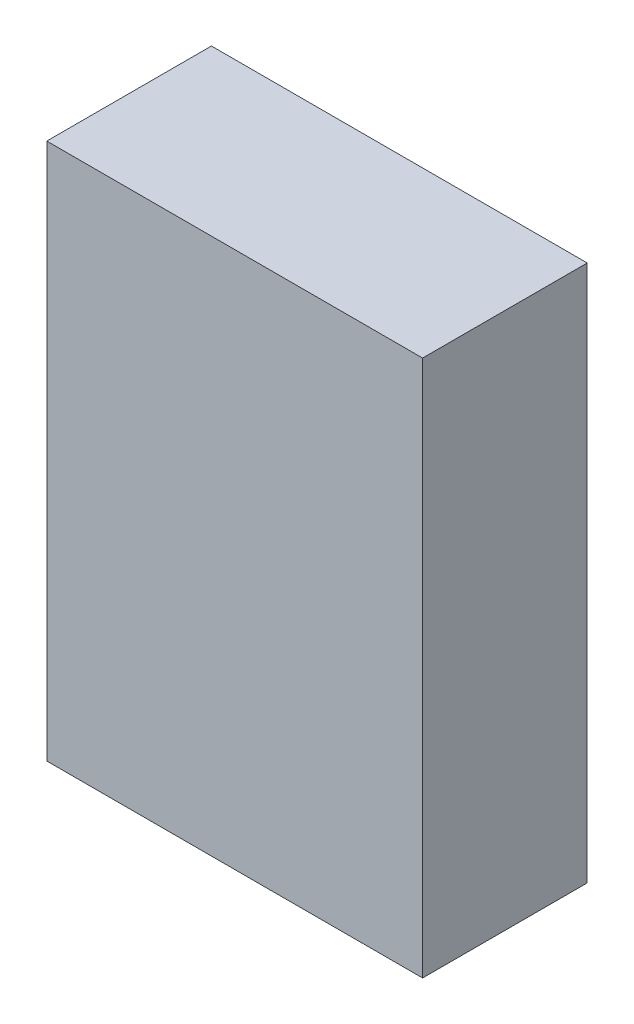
ISO-10303-21;
HEADER;
FILE_DESCRIPTION(('STEP AP214'),'2;1');
FILE_NAME('part.step','',(''),(''),'','','');
FILE_SCHEMA(('AUTOMOTIVE_DESIGN { 1 0 10303 214 1 1 1 1 }'));
ENDSEC;
DATA;
#1=APPLICATION_CONTEXT('core data for automotive mechanical design processes');
#2=APPLICATION_PROTOCOL_DEFINITION('international standard','automotive_design',2000,#1);
#3=PRODUCT_CONTEXT('',#1,'mechanical');
#4=PRODUCT('Part','Part','',(#3));
#5=PRODUCT_RELATED_PRODUCT_CATEGORY('part','',(#4));
#6=PRODUCT_DEFINITION_FORMATION('','',#4);
#7=PRODUCT_DEFINITION_CONTEXT('part definition',#1,'design');
#8=PRODUCT_DEFINITION('design','',#6,#7);
#9=PRODUCT_DEFINITION_SHAPE('','',#8);
#10=(LENGTH_UNIT() NAMED_UNIT(*) SI_UNIT(.MILLI.,.METRE.));
#11=(NAMED_UNIT(*) PLANE_ANGLE_UNIT() SI_UNIT($,.RADIAN.));
#12=(NAMED_UNIT(*) SI_UNIT($,.STERADIAN.) SOLID_ANGLE_UNIT());
#13=UNCERTAINTY_MEASURE_WITH_UNIT(LENGTH_MEASURE(1.E-05),#10,'distance_accuracy_value','');
#14=(GEOMETRIC_REPRESENTATION_CONTEXT(3) GLOBAL_UNCERTAINTY_ASSIGNED_CONTEXT((#13)) GLOBAL_UNIT_ASSIGNED_CONTEXT((#10,
#11,#12)) REPRESENTATION_CONTEXT('',''));
#15=CARTESIAN_POINT('',(0.,0.,0.));
#16=DIRECTION('',(0.,0.,1.));
#17=DIRECTION('',(1.,0.,0.));
#18=AXIS2_PLACEMENT_3D('',#15,#16,#17);
#19=CARTESIAN_POINT('',(0.533386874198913,0.750092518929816,4.58969577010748E-08));
#20=DIRECTION('',(4.37113882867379E-08,0.,-0.999999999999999));
#21=DIRECTION('',(0.999999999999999,1.1924880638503E-08,4.37113882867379E-08));
#22=AXIS2_PLACEMENT_3D('',#19,#20,#21);
#23=PLANE('',#22);
#24=DIRECTION('',(1.19248806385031E-08,-1.,0.));
#25=VECTOR('',#24,1.);
#26=CARTESIAN_POINT('',(0.483386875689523,0.625092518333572,4.37113882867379E-08));
#27=LINE('',#26,#25);
#28=CARTESIAN_POINT('',(0.483386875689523,0.625092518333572,4.37113882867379E-08));
#29=VERTEX_POINT('',#28);
#30=CARTESIAN_POINT('',(0.483386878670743,0.375092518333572,4.37113882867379E-08));
#31=VERTEX_POINT('',#30);
#32=EDGE_CURVE('E11',#29,#31,#27,.T.);
#33=ORIENTED_EDGE('',*,*,#32,.F.);
#34=DIRECTION('',(0.999999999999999,1.1924880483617E-08,4.37113882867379E-08));
#35=VECTOR('',#34,1.);
#36=CARTESIAN_POINT('',(0.133386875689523,0.625092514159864,2.84124023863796E-08));
#37=LINE('',#36,#35);
#38=CARTESIAN_POINT('',(0.133386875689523,0.625092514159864,2.84124023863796E-08));
#39=VERTEX_POINT('',#38);
#40=EDGE_CURVE('E24',#39,#29,#37,.T.);
#41=ORIENTED_EDGE('',*,*,#40,.F.);
#42=DIRECTION('',(-1.19248810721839E-08,1.,0.));
#43=VECTOR('',#42,1.);
#44=CARTESIAN_POINT('',(0.133386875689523,0.625092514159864,2.84124023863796E-08));
#45=LINE('',#44,#43);
#46=CARTESIAN_POINT('',(0.133386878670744,0.375092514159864,2.84124023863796E-08));
#47=VERTEX_POINT('',#46);
#48=EDGE_CURVE('E441',#47,#39,#45,.T.);
#49=ORIENTED_EDGE('',*,*,#48,.F.);
#50=DIRECTION('',(-0.999999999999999,-1.1924880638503E-08,-4.37113882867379E-08));
#51=VECTOR('',#50,1.);
#52=CARTESIAN_POINT('',(0.133386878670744,0.375092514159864,2.84124023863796E-08));
#53=LINE('',#52,#51);
#54=EDGE_CURVE('E438',#31,#47,#53,.T.);
#55=ORIENTED_EDGE('',*,*,#54,.F.);
#56=EDGE_LOOP('',(#33,#41,#49,#55));
#57=FACE_BOUND('',#56,.T.);
#58=DIRECTION('',(1.19248806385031E-08,-1.,0.));
#59=VECTOR('',#58,1.);
#60=CARTESIAN_POINT('',(0.483386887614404,-0.374907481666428,4.37113882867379E-08));
#61=LINE('',#60,#59);
#62=CARTESIAN_POINT('',(0.483386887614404,-0.374907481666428,4.37113882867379E-08));
#63=VERTEX_POINT('',#62);
#64=CARTESIAN_POINT('',(0.483386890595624,-0.624907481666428,4.37113882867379E-08));
#65=VERTEX_POINT('',#64);
#66=EDGE_CURVE('E436',#63,#65,#61,.T.);
#67=ORIENTED_EDGE('',*,*,#66,.F.);
#68=DIRECTION('',(0.999999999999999,1.1924880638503E-08,4.37113882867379E-08));
#69=VECTOR('',#68,1.);
#70=CARTESIAN_POINT('',(0.133386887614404,-0.374907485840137,2.84124023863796E-08));
#71=LINE('',#70,#69);
#72=CARTESIAN_POINT('',(0.133386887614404,-0.374907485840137,2.84124023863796E-08));
#73=VERTEX_POINT('',#72);
#74=EDGE_CURVE('E433',#73,#63,#71,.T.);
#75=ORIENTED_EDGE('',*,*,#74,.F.);
#76=DIRECTION('',(-1.19248810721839E-08,1.,0.));
#77=VECTOR('',#76,1.);
#78=CARTESIAN_POINT('',(0.133386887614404,-0.374907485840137,2.84124023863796E-08));
#79=LINE('',#78,#77);
#80=CARTESIAN_POINT('',(0.133386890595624,-0.624907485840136,2.84124023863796E-08));
#81=VERTEX_POINT('',#80);
#82=EDGE_CURVE('E430',#81,#73,#79,.T.);
#83=ORIENTED_EDGE('',*,*,#82,.F.);
#84=DIRECTION('',(-0.999999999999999,-1.1924880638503E-08,-4.37113882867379E-08));
#85=VECTOR('',#84,1.);
#86=CARTESIAN_POINT('',(0.133386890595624,-0.624907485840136,2.84124023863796E-08));
#87=LINE('',#86,#85);
#88=EDGE_CURVE('E427',#65,#81,#87,.T.);
#89=ORIENTED_EDGE('',*,*,#88,.F.);
#90=EDGE_LOOP('',(#67,#75,#83,#89));
#91=FACE_BOUND('',#90,.T.);
#92=DIRECTION('',(1.19248808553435E-08,-1.,0.));
#93=VECTOR('',#92,1.);
#94=CARTESIAN_POINT('',(-0.116613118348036,0.125092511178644,1.74845553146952E-08));
#95=LINE('',#94,#93);
#96=CARTESIAN_POINT('',(-0.116613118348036,0.125092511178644,1.74845553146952E-08));
#97=VERTEX_POINT('',#96);
#98=CARTESIAN_POINT('',(-0.116613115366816,-0.124907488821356,1.74845553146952E-08));
#99=VERTEX_POINT('',#98);
#100=EDGE_CURVE('E425',#97,#99,#95,.T.);
#101=ORIENTED_EDGE('',*,*,#100,.F.);
#102=DIRECTION('',(0.999999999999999,1.1924880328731E-08,4.37113882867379E-08));
#103=VECTOR('',#102,1.);
#104=CARTESIAN_POINT('',(-0.466613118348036,0.125092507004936,2.18556941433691E-09));
#105=LINE('',#104,#103);
#106=CARTESIAN_POINT('',(-0.466613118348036,0.125092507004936,2.18556941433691E-09));
#107=VERTEX_POINT('',#106);
#108=EDGE_CURVE('E422',#107,#97,#105,.T.);
#109=ORIENTED_EDGE('',*,*,#108,.F.);
#110=DIRECTION('',(-1.19248806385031E-08,1.,0.));
#111=VECTOR('',#110,1.);
#112=CARTESIAN_POINT('',(-0.466613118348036,0.125092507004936,2.18556941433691E-09));
#113=LINE('',#112,#111);
#114=CARTESIAN_POINT('',(-0.466613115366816,-0.124907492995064,2.18556941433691E-09));
#115=VERTEX_POINT('',#114);
#116=EDGE_CURVE('E419',#115,#107,#113,.T.);
#117=ORIENTED_EDGE('',*,*,#116,.F.);
#118=DIRECTION('',(-0.999999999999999,-1.1924880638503E-08,-4.37113882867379E-08));
#119=VECTOR('',#118,1.);
#120=CARTESIAN_POINT('',(-0.466613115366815,-0.124907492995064,2.18556941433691E-09));
#121=LINE('',#120,#119);
#122=EDGE_CURVE('E416',#99,#115,#121,.T.);
#123=ORIENTED_EDGE('',*,*,#122,.F.);
#124=EDGE_LOOP('',(#101,#109,#117,#123));
#125=FACE_BOUND('',#124,.T.);
#126=DIRECTION('',(-0.999999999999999,-1.1924880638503E-08,-4.37113882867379E-08));
#127=VECTOR('',#126,1.);
#128=CARTESIAN_POINT('',(-0.516613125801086,0.750092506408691,0.));
#129=LINE('',#128,#127);
#130=CARTESIAN_POINT('',(0.533386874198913,0.750092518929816,4.58969577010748E-08));
#131=VERTEX_POINT('',#130);
#132=CARTESIAN_POINT('',(-0.516613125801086,0.750092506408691,0.));
#133=VERTEX_POINT('',#132);
#134=EDGE_CURVE('E413',#131,#133,#129,.T.);
#135=ORIENTED_EDGE('',*,*,#134,.F.);
#136=DIRECTION('',(-1.19248806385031E-08,1.,0.));
#137=VECTOR('',#136,1.);
#138=CARTESIAN_POINT('',(0.533386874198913,0.750092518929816,4.58969577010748E-08));
#139=LINE('',#138,#137);
#140=CARTESIAN_POINT('',(0.533386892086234,-0.749907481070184,4.58969577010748E-08));
#141=VERTEX_POINT('',#140);
#142=EDGE_CURVE('E410',#141,#131,#139,.T.);
#143=ORIENTED_EDGE('',*,*,#142,.F.);
#144=DIRECTION('',(0.999999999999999,1.19248818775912E-08,4.37113882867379E-08));
#145=VECTOR('',#144,1.);
#146=CARTESIAN_POINT('',(-0.516613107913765,-0.74990749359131,0.));
#147=LINE('',#146,#145);
#148=CARTESIAN_POINT('',(-0.516613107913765,-0.74990749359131,0.));
#149=VERTEX_POINT('',#148);
#150=EDGE_CURVE('E407',#149,#141,#147,.T.);
#151=ORIENTED_EDGE('',*,*,#150,.F.);
#152=DIRECTION('',(1.19248806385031E-08,-1.,0.));
#153=VECTOR('',#152,1.);
#154=CARTESIAN_POINT('',(-0.516613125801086,0.750092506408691,0.));
#155=LINE('',#154,#153);
#156=EDGE_CURVE('E404',#133,#149,#155,.T.);
#157=ORIENTED_EDGE('',*,*,#156,.F.);
#158=EDGE_LOOP('',(#135,#143,#151,#157));
#159=FACE_BOUND('',#158,.T.);
#160=DIRECTION('',(1.19248806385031E-08,-1.,0.));
#161=VECTOR('',#160,1.);
#162=CARTESIAN_POINT('',(-0.116613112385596,-0.374907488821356,1.74845553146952E-08));
#163=LINE('',#162,#161);
#164=CARTESIAN_POINT('',(-0.116613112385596,-0.374907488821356,1.74845553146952E-08));
#165=VERTEX_POINT('',#164);
#166=CARTESIAN_POINT('',(-0.116613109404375,-0.624907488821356,1.74845553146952E-08));
#167=VERTEX_POINT('',#166);
#168=EDGE_CURVE('E401',#165,#167,#163,.T.);
#169=ORIENTED_EDGE('',*,*,#168,.F.);
#170=DIRECTION('',(0.999999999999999,1.1924880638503E-08,4.37113882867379E-08));
#171=VECTOR('',#170,1.);
#172=CARTESIAN_POINT('',(-0.466613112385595,-0.374907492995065,2.18556941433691E-09));
#173=LINE('',#172,#171);
#174=CARTESIAN_POINT('',(-0.466613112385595,-0.374907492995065,2.18556941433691E-09));
#175=VERTEX_POINT('',#174);
#176=EDGE_CURVE('E398',#175,#165,#173,.T.);
#177=ORIENTED_EDGE('',*,*,#176,.F.);
#178=DIRECTION('',(-1.19248806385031E-08,1.,0.));
#179=VECTOR('',#178,1.);
#180=CARTESIAN_POINT('',(-0.466613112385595,-0.374907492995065,2.18556941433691E-09));
#181=LINE('',#180,#179);
#182=CARTESIAN_POINT('',(-0.466613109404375,-0.624907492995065,2.18556941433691E-09));
#183=VERTEX_POINT('',#182);
#184=EDGE_CURVE('E395',#183,#175,#181,.T.);
#185=ORIENTED_EDGE('',*,*,#184,.F.);
#186=DIRECTION('',(-0.999999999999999,-1.1924880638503E-08,-4.37113882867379E-08));
#187=VECTOR('',#186,1.);
#188=CARTESIAN_POINT('',(-0.466613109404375,-0.624907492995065,2.18556941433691E-09));
#189=LINE('',#188,#187);
#190=EDGE_CURVE('E392',#167,#183,#189,.T.);
#191=ORIENTED_EDGE('',*,*,#190,.F.);
#192=EDGE_LOOP('',(#169,#177,#185,#191));
#193=FACE_BOUND('',#192,.T.);
#194=DIRECTION('',(1.19248806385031E-08,-1.,0.));
#195=VECTOR('',#194,1.);
#196=CARTESIAN_POINT('',(0.483386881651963,0.125092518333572,4.37113882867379E-08));
#197=LINE('',#196,#195);
#198=CARTESIAN_POINT('',(0.483386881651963,0.125092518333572,4.37113882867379E-08));
#199=VERTEX_POINT('',#198);
#200=CARTESIAN_POINT('',(0.483386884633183,-0.124907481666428,4.37113882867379E-08));
#201=VERTEX_POINT('',#200);
#202=EDGE_CURVE('E389',#199,#201,#197,.T.);
#203=ORIENTED_EDGE('',*,*,#202,.F.);
#204=DIRECTION('',(0.999999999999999,1.1924880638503E-08,4.37113882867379E-08));
#205=VECTOR('',#204,1.);
#206=CARTESIAN_POINT('',(0.133386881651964,0.125092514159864,2.84124023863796E-08));
#207=LINE('',#206,#205);
#208=CARTESIAN_POINT('',(0.133386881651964,0.125092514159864,2.84124023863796E-08));
#209=VERTEX_POINT('',#208);
#210=EDGE_CURVE('E387',#209,#199,#207,.T.);
#211=ORIENTED_EDGE('',*,*,#210,.F.);
#212=DIRECTION('',(-1.19248806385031E-08,1.,0.));
#213=VECTOR('',#212,1.);
#214=CARTESIAN_POINT('',(0.133386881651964,0.125092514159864,2.84124023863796E-08));
#215=LINE('',#214,#213);
#216=CARTESIAN_POINT('',(0.133386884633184,-0.124907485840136,2.84124023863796E-08));
#217=VERTEX_POINT('',#216);
#218=EDGE_CURVE('E384',#217,#209,#215,.T.);
#219=ORIENTED_EDGE('',*,*,#218,.F.);
#220=DIRECTION('',(-0.999999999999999,-1.1924880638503E-08,-4.37113882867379E-08));
#221=VECTOR('',#220,1.);
#222=CARTESIAN_POINT('',(0.133386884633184,-0.124907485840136,2.84124023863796E-08));
#223=LINE('',#222,#221);
#224=EDGE_CURVE('E381',#201,#217,#223,.T.);
#225=ORIENTED_EDGE('',*,*,#224,.F.);
#226=EDGE_LOOP('',(#203,#211,#219,#225));
#227=FACE_BOUND('',#226,.T.);
#228=DIRECTION('',(-1.19248806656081E-08,1.,0.));
#229=VECTOR('',#228,1.);
#230=CARTESIAN_POINT('',(-0.466613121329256,0.375092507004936,2.18556941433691E-09));
#231=LINE('',#230,#229);
#232=CARTESIAN_POINT('',(-0.466613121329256,0.375092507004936,2.18556941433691E-09));
#233=VERTEX_POINT('',#232);
#234=CARTESIAN_POINT('',(-0.466613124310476,0.625092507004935,2.18556941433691E-09));
#235=VERTEX_POINT('',#234);
#236=EDGE_CURVE('E379',#233,#235,#231,.T.);
#237=ORIENTED_EDGE('',*,*,#236,.F.);
#238=DIRECTION('',(-0.999999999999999,-1.1924880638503E-08,-4.37113882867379E-08));
#239=VECTOR('',#238,1.);
#240=CARTESIAN_POINT('',(-0.0666131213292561,0.375092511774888,1.96701247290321E-08));
#241=LINE('',#240,#239);
#242=CARTESIAN_POINT('',(-0.0666131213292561,0.375092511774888,1.96701247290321E-08));
#243=VERTEX_POINT('',#242);
#244=EDGE_CURVE('E376',#243,#233,#241,.T.);
#245=ORIENTED_EDGE('',*,*,#244,.F.);
#246=DIRECTION('',(1.19248806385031E-08,-1.,0.));
#247=VECTOR('',#246,1.);
#248=CARTESIAN_POINT('',(-0.0666131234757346,0.555092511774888,1.96701247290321E-08));
#249=LINE('',#248,#247);
#250=CARTESIAN_POINT('',(-0.0666131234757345,0.555092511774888,1.96701247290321E-08));
#251=VERTEX_POINT('',#250);
#252=EDGE_CURVE('E374',#251,#243,#249,.T.);
#253=ORIENTED_EDGE('',*,*,#252,.F.);
#254=DIRECTION('',(0.731055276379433,-0.682318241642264,3.19554406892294E-08));
#255=VECTOR('',#254,1.);
#256=CARTESIAN_POINT('',(-0.141613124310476,0.625092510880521,1.63917706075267E-08));
#257=LINE('',#256,#255);
#258=CARTESIAN_POINT('',(-0.141613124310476,0.625092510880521,1.63917706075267E-08));
#259=VERTEX_POINT('',#258);
#260=EDGE_CURVE('E210',#259,#251,#257,.T.);
#261=ORIENTED_EDGE('',*,*,#260,.F.);
#262=DIRECTION('',(0.999999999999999,1.1924880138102E-08,4.37113882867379E-08));
#263=VECTOR('',#262,1.);
#264=CARTESIAN_POINT('',(-0.466613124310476,0.625092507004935,2.18556941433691E-09));
#265=LINE('',#264,#263);
#266=EDGE_CURVE('E370',#235,#259,#265,.T.);
#267=ORIENTED_EDGE('',*,*,#266,.F.);
#268=EDGE_LOOP('',(#237,#245,#253,#261,#267));
#269=FACE_BOUND('',#268,.T.);
#270=ADVANCED_FACE('F17',(#57,#91,#125,#159,#193,#227,#269),#23,.T.);
#271=CARTESIAN_POINT('',(-0.516613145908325,0.750092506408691,0.46));
#272=DIRECTION('',(1.19248806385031E-08,-1.,0.));
#273=DIRECTION('',(0.999999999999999,1.1924880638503E-08,4.37113882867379E-08));
#274=AXIS2_PLACEMENT_3D('',#271,#272,#273);
#275=PLANE('',#274);
#276=ORIENTED_EDGE('',*,*,#134,.T.);
#277=DIRECTION('',(4.37113882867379E-08,0.,-0.999999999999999));
#278=VECTOR('',#277,1.);
#279=CARTESIAN_POINT('',(-0.516613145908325,0.750092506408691,0.46));
#280=LINE('',#279,#278);
#281=CARTESIAN_POINT('',(-0.516613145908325,0.750092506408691,0.46));
#282=VERTEX_POINT('',#281);
#283=EDGE_CURVE('E368',#282,#133,#280,.T.);
#284=ORIENTED_EDGE('',*,*,#283,.F.);
#285=DIRECTION('',(-0.999999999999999,-1.1924880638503E-08,-4.37113882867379E-08));
#286=VECTOR('',#285,1.);
#287=CARTESIAN_POINT('',(-0.516613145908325,0.750092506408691,0.46));
#288=LINE('',#287,#286);
#289=CARTESIAN_POINT('',(0.533386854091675,0.750092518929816,0.460000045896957));
#290=VERTEX_POINT('',#289);
#291=EDGE_CURVE('E365',#290,#282,#288,.T.);
#292=ORIENTED_EDGE('',*,*,#291,.F.);
#293=DIRECTION('',(4.37113882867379E-08,0.,-0.999999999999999));
#294=VECTOR('',#293,1.);
#295=CARTESIAN_POINT('',(0.533386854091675,0.750092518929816,0.460000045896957));
#296=LINE('',#295,#294);
#297=EDGE_CURVE('E362',#290,#131,#296,.T.);
#298=ORIENTED_EDGE('',*,*,#297,.T.);
#299=EDGE_LOOP('',(#276,#284,#292,#298));
#300=FACE_BOUND('',#299,.T.);
#301=ADVANCED_FACE('F460',(#300),#275,.F.);
#302=CARTESIAN_POINT('',(-0.516613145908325,0.750092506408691,0.46));
#303=DIRECTION('',(0.999999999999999,1.1924880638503E-08,4.37113882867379E-08));
#304=DIRECTION('',(-1.19248806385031E-08,1.,0.));
#305=AXIS2_PLACEMENT_3D('',#302,#303,#304);
#306=PLANE('',#305);
#307=ORIENTED_EDGE('',*,*,#156,.T.);
#308=DIRECTION('',(4.37113882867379E-08,0.,-0.999999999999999));
#309=VECTOR('',#308,1.);
#310=CARTESIAN_POINT('',(-0.516613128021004,-0.74990749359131,0.46));
#311=LINE('',#310,#309);
#312=CARTESIAN_POINT('',(-0.516613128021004,-0.74990749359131,0.46));
#313=VERTEX_POINT('',#312);
#314=EDGE_CURVE('E360',#313,#149,#311,.T.);
#315=ORIENTED_EDGE('',*,*,#314,.F.);
#316=DIRECTION('',(1.19248806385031E-08,-1.,0.));
#317=VECTOR('',#316,1.);
#318=CARTESIAN_POINT('',(-0.516613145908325,0.750092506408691,0.46));
#319=LINE('',#318,#317);
#320=EDGE_CURVE('E357',#282,#313,#319,.T.);
#321=ORIENTED_EDGE('',*,*,#320,.F.);
#322=ORIENTED_EDGE('',*,*,#283,.T.);
#323=EDGE_LOOP('',(#307,#315,#321,#322));
#324=FACE_BOUND('',#323,.T.);
#325=ADVANCED_FACE('F598',(#324),#306,.F.);
#326=CARTESIAN_POINT('',(-0.516613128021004,-0.74990749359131,0.46));
#327=DIRECTION('',(-1.19248818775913E-08,1.,0.));
#328=DIRECTION('',(-0.999999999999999,-1.19248818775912E-08,-4.37113882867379E-08));
#329=AXIS2_PLACEMENT_3D('',#326,#327,#328);
#330=PLANE('',#329);
#331=ORIENTED_EDGE('',*,*,#150,.T.);
#332=DIRECTION('',(4.37113882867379E-08,0.,-0.999999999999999));
#333=VECTOR('',#332,1.);
#334=CARTESIAN_POINT('',(0.533386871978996,-0.749907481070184,0.460000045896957));
#335=LINE('',#334,#333);
#336=CARTESIAN_POINT('',(0.533386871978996,-0.749907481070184,0.460000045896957));
#337=VERTEX_POINT('',#336);
#338=EDGE_CURVE('E355',#337,#141,#335,.T.);
#339=ORIENTED_EDGE('',*,*,#338,.F.);
#340=DIRECTION('',(0.999999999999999,1.19248818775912E-08,4.37113882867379E-08));
#341=VECTOR('',#340,1.);
#342=CARTESIAN_POINT('',(-0.516613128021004,-0.74990749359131,0.46));
#343=LINE('',#342,#341);
#344=EDGE_CURVE('E352',#313,#337,#343,.T.);
#345=ORIENTED_EDGE('',*,*,#344,.F.);
#346=ORIENTED_EDGE('',*,*,#314,.T.);
#347=EDGE_LOOP('',(#331,#339,#345,#346));
#348=FACE_BOUND('',#347,.T.);
#349=ADVANCED_FACE('F594',(#348),#330,.F.);
#350=CARTESIAN_POINT('',(0.533386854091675,0.750092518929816,0.460000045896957));
#351=DIRECTION('',(-0.999999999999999,-1.1924880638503E-08,-4.37113882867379E-08));
#352=DIRECTION('',(1.19248806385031E-08,-1.,0.));
#353=AXIS2_PLACEMENT_3D('',#350,#351,#352);
#354=PLANE('',#353);
#355=ORIENTED_EDGE('',*,*,#142,.T.);
#356=ORIENTED_EDGE('',*,*,#297,.F.);
#357=DIRECTION('',(-1.19248806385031E-08,1.,0.));
#358=VECTOR('',#357,1.);
#359=CARTESIAN_POINT('',(0.533386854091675,0.750092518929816,0.460000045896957));
#360=LINE('',#359,#358);
#361=EDGE_CURVE('E349',#337,#290,#360,.T.);
#362=ORIENTED_EDGE('',*,*,#361,.F.);
#363=ORIENTED_EDGE('',*,*,#338,.T.);
#364=EDGE_LOOP('',(#355,#356,#362,#363));
#365=FACE_BOUND('',#364,.T.);
#366=ADVANCED_FACE('F590',(#365),#354,.F.);
#367=CARTESIAN_POINT('',(0.533386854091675,0.750092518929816,0.460000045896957));
#368=DIRECTION('',(4.37113882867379E-08,0.,-0.999999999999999));
#369=DIRECTION('',(0.999999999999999,1.1924880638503E-08,4.37113882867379E-08));
#370=AXIS2_PLACEMENT_3D('',#367,#368,#369);
#371=PLANE('',#370);
#372=ORIENTED_EDGE('',*,*,#291,.T.);
#373=ORIENTED_EDGE('',*,*,#320,.T.);
#374=ORIENTED_EDGE('',*,*,#344,.T.);
#375=ORIENTED_EDGE('',*,*,#361,.T.);
#376=EDGE_LOOP('',(#372,#373,#374,#375));
#377=FACE_BOUND('',#376,.T.);
#378=ADVANCED_FACE('F586',(#377),#371,.F.);
#379=CARTESIAN_POINT('',(-0.46661311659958,0.125092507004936,-0.0399999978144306));
#380=DIRECTION('',(1.1924880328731E-08,-1.,0.));
#381=DIRECTION('',(0.999999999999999,1.1924880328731E-08,4.37113882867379E-08));
#382=AXIS2_PLACEMENT_3D('',#379,#380,#381);
#383=PLANE('',#382);
#384=ORIENTED_EDGE('',*,*,#108,.T.);
#385=DIRECTION('',(-4.37113882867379E-08,0.,0.999999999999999));
#386=VECTOR('',#385,1.);
#387=CARTESIAN_POINT('',(-0.11661311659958,0.125092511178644,-0.0399999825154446));
#388=LINE('',#387,#386);
#389=CARTESIAN_POINT('',(-0.11661311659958,0.125092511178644,-0.0399999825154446));
#390=VERTEX_POINT('',#389);
#391=EDGE_CURVE('E346',#390,#97,#388,.T.);
#392=ORIENTED_EDGE('',*,*,#391,.F.);
#393=DIRECTION('',(0.999999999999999,1.1924880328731E-08,4.37113882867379E-08));
#394=VECTOR('',#393,1.);
#395=CARTESIAN_POINT('',(-0.46661311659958,0.125092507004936,-0.0399999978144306));
#396=LINE('',#395,#394);
#397=CARTESIAN_POINT('',(-0.46661311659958,0.125092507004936,-0.0399999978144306));
#398=VERTEX_POINT('',#397);
#399=EDGE_CURVE('E343',#398,#390,#396,.T.);
#400=ORIENTED_EDGE('',*,*,#399,.F.);
#401=DIRECTION('',(-4.37113882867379E-08,0.,0.999999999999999));
#402=VECTOR('',#401,1.);
#403=CARTESIAN_POINT('',(-0.46661311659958,0.125092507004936,-0.0399999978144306));
#404=LINE('',#403,#402);
#405=EDGE_CURVE('E340',#398,#107,#404,.T.);
#406=ORIENTED_EDGE('',*,*,#405,.T.);
#407=EDGE_LOOP('',(#384,#392,#400,#406));
#408=FACE_BOUND('',#407,.T.);
#409=ADVANCED_FACE('F582',(#408),#383,.F.);
#410=CARTESIAN_POINT('',(-0.11661311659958,0.125092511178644,-0.0399999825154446));
#411=DIRECTION('',(-0.999999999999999,-1.19248808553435E-08,-4.37113882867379E-08));
#412=DIRECTION('',(1.19248808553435E-08,-1.,0.));
#413=AXIS2_PLACEMENT_3D('',#410,#411,#412);
#414=PLANE('',#413);
#415=ORIENTED_EDGE('',*,*,#100,.T.);
#416=DIRECTION('',(-4.37113882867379E-08,0.,0.999999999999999));
#417=VECTOR('',#416,1.);
#418=CARTESIAN_POINT('',(-0.11661311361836,-0.124907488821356,-0.0399999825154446));
#419=LINE('',#418,#417);
#420=CARTESIAN_POINT('',(-0.11661311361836,-0.124907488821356,-0.0399999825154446));
#421=VERTEX_POINT('',#420);
#422=EDGE_CURVE('E337',#421,#99,#419,.T.);
#423=ORIENTED_EDGE('',*,*,#422,.F.);
#424=DIRECTION('',(1.19248808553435E-08,-1.,0.));
#425=VECTOR('',#424,1.);
#426=CARTESIAN_POINT('',(-0.11661311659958,0.125092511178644,-0.0399999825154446));
#427=LINE('',#426,#425);
#428=EDGE_CURVE('E334',#390,#421,#427,.T.);
#429=ORIENTED_EDGE('',*,*,#428,.F.);
#430=ORIENTED_EDGE('',*,*,#391,.T.);
#431=EDGE_LOOP('',(#415,#423,#429,#430));
#432=FACE_BOUND('',#431,.T.);
#433=ADVANCED_FACE('F578',(#432),#414,.F.);
#434=CARTESIAN_POINT('',(-0.46661311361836,-0.124907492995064,-0.0399999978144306));
#435=DIRECTION('',(-1.19248806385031E-08,1.,0.));
#436=DIRECTION('',(-0.999999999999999,-1.1924880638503E-08,-4.37113882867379E-08));
#437=AXIS2_PLACEMENT_3D('',#434,#435,#436);
#438=PLANE('',#437);
#439=ORIENTED_EDGE('',*,*,#122,.T.);
#440=DIRECTION('',(-4.37113882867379E-08,0.,0.999999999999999));
#441=VECTOR('',#440,1.);
#442=CARTESIAN_POINT('',(-0.46661311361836,-0.124907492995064,-0.0399999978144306));
#443=LINE('',#442,#441);
#444=CARTESIAN_POINT('',(-0.46661311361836,-0.124907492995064,-0.0399999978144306));
#445=VERTEX_POINT('',#444);
#446=EDGE_CURVE('E331',#445,#115,#443,.T.);
#447=ORIENTED_EDGE('',*,*,#446,.F.);
#448=DIRECTION('',(-0.999999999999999,-1.1924880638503E-08,-4.37113882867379E-08));
#449=VECTOR('',#448,1.);
#450=CARTESIAN_POINT('',(-0.46661311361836,-0.124907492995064,-0.0399999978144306));
#451=LINE('',#450,#449);
#452=EDGE_CURVE('E329',#421,#445,#451,.T.);
#453=ORIENTED_EDGE('',*,*,#452,.F.);
#454=ORIENTED_EDGE('',*,*,#422,.T.);
#455=EDGE_LOOP('',(#439,#447,#453,#454));
#456=FACE_BOUND('',#455,.T.);
#457=ADVANCED_FACE('F574',(#456),#438,.F.);
#458=CARTESIAN_POINT('',(-0.46661311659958,0.125092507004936,-0.0399999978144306));
#459=DIRECTION('',(0.999999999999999,1.1924880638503E-08,4.37113882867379E-08));
#460=DIRECTION('',(-1.19248806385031E-08,1.,0.));
#461=AXIS2_PLACEMENT_3D('',#458,#459,#460);
#462=PLANE('',#461);
#463=ORIENTED_EDGE('',*,*,#116,.T.);
#464=ORIENTED_EDGE('',*,*,#405,.F.);
#465=DIRECTION('',(-1.19248806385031E-08,1.,0.));
#466=VECTOR('',#465,1.);
#467=CARTESIAN_POINT('',(-0.46661311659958,0.125092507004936,-0.0399999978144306));
#468=LINE('',#467,#466);
#469=EDGE_CURVE('E327',#445,#398,#468,.T.);
#470=ORIENTED_EDGE('',*,*,#469,.F.);
#471=ORIENTED_EDGE('',*,*,#446,.T.);
#472=EDGE_LOOP('',(#463,#464,#470,#471));
#473=FACE_BOUND('',#472,.T.);
#474=ADVANCED_FACE('F570',(#473),#462,.F.);
#475=CARTESIAN_POINT('',(-0.11661311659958,0.125092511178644,-0.0399999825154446));
#476=DIRECTION('',(4.37113882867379E-08,0.,-0.999999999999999));
#477=DIRECTION('',(0.999999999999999,1.1924880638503E-08,4.37113882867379E-08));
#478=AXIS2_PLACEMENT_3D('',#475,#476,#477);
#479=PLANE('',#478);
#480=ORIENTED_EDGE('',*,*,#399,.T.);
#481=ORIENTED_EDGE('',*,*,#428,.T.);
#482=ORIENTED_EDGE('',*,*,#452,.T.);
#483=ORIENTED_EDGE('',*,*,#469,.T.);
#484=EDGE_LOOP('',(#480,#481,#482,#483));
#485=FACE_BOUND('',#484,.T.);
#486=ADVANCED_FACE('F566',(#485),#479,.T.);
#487=CARTESIAN_POINT('',(-0.46661311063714,-0.374907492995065,-0.0399999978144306));
#488=DIRECTION('',(1.19248806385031E-08,-1.,0.));
#489=DIRECTION('',(0.999999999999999,1.1924880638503E-08,4.37113882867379E-08));
#490=AXIS2_PLACEMENT_3D('',#487,#488,#489);
#491=PLANE('',#490);
#492=ORIENTED_EDGE('',*,*,#176,.T.);
#493=DIRECTION('',(-4.37113882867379E-08,0.,0.999999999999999));
#494=VECTOR('',#493,1.);
#495=CARTESIAN_POINT('',(-0.11661311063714,-0.374907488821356,-0.0399999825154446));
#496=LINE('',#495,#494);
#497=CARTESIAN_POINT('',(-0.11661311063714,-0.374907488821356,-0.0399999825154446));
#498=VERTEX_POINT('',#497);
#499=EDGE_CURVE('E325',#498,#165,#496,.T.);
#500=ORIENTED_EDGE('',*,*,#499,.F.);
#501=DIRECTION('',(0.999999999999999,1.1924880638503E-08,4.37113882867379E-08));
#502=VECTOR('',#501,1.);
#503=CARTESIAN_POINT('',(-0.46661311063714,-0.374907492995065,-0.0399999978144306));
#504=LINE('',#503,#502);
#505=CARTESIAN_POINT('',(-0.46661311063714,-0.374907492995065,-0.0399999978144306));
#506=VERTEX_POINT('',#505);
#507=EDGE_CURVE('E322',#506,#498,#504,.T.);
#508=ORIENTED_EDGE('',*,*,#507,.F.);
#509=DIRECTION('',(-4.37113882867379E-08,0.,0.999999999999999));
#510=VECTOR('',#509,1.);
#511=CARTESIAN_POINT('',(-0.46661311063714,-0.374907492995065,-0.0399999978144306));
#512=LINE('',#511,#510);
#513=EDGE_CURVE('E320',#506,#175,#512,.T.);
#514=ORIENTED_EDGE('',*,*,#513,.T.);
#515=EDGE_LOOP('',(#492,#500,#508,#514));
#516=FACE_BOUND('',#515,.T.);
#517=ADVANCED_FACE('F562',(#516),#491,.F.);
#518=CARTESIAN_POINT('',(-0.11661311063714,-0.374907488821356,-0.0399999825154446));
#519=DIRECTION('',(-0.999999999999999,-1.1924880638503E-08,-4.37113882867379E-08));
#520=DIRECTION('',(1.19248806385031E-08,-1.,0.));
#521=AXIS2_PLACEMENT_3D('',#518,#519,#520);
#522=PLANE('',#521);
#523=ORIENTED_EDGE('',*,*,#168,.T.);
#524=DIRECTION('',(-4.37113882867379E-08,0.,0.999999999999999));
#525=VECTOR('',#524,1.);
#526=CARTESIAN_POINT('',(-0.11661310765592,-0.624907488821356,-0.0399999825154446));
#527=LINE('',#526,#525);
#528=CARTESIAN_POINT('',(-0.11661310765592,-0.624907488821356,-0.0399999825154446));
#529=VERTEX_POINT('',#528);
#530=EDGE_CURVE('E318',#529,#167,#527,.T.);
#531=ORIENTED_EDGE('',*,*,#530,.F.);
#532=DIRECTION('',(1.19248806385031E-08,-1.,0.));
#533=VECTOR('',#532,1.);
#534=CARTESIAN_POINT('',(-0.11661311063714,-0.374907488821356,-0.0399999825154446));
#535=LINE('',#534,#533);
#536=EDGE_CURVE('E315',#498,#529,#535,.T.);
#537=ORIENTED_EDGE('',*,*,#536,.F.);
#538=ORIENTED_EDGE('',*,*,#499,.T.);
#539=EDGE_LOOP('',(#523,#531,#537,#538));
#540=FACE_BOUND('',#539,.T.);
#541=ADVANCED_FACE('F558',(#540),#522,.F.);
#542=CARTESIAN_POINT('',(-0.46661310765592,-0.624907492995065,-0.0399999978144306));
#543=DIRECTION('',(-1.19248806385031E-08,1.,0.));
#544=DIRECTION('',(-0.999999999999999,-1.1924880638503E-08,-4.37113882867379E-08));
#545=AXIS2_PLACEMENT_3D('',#542,#543,#544);
#546=PLANE('',#545);
#547=ORIENTED_EDGE('',*,*,#190,.T.);
#548=DIRECTION('',(-4.37113882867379E-08,0.,0.999999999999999));
#549=VECTOR('',#548,1.);
#550=CARTESIAN_POINT('',(-0.46661310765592,-0.624907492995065,-0.0399999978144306));
#551=LINE('',#550,#549);
#552=CARTESIAN_POINT('',(-0.46661310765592,-0.624907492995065,-0.0399999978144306));
#553=VERTEX_POINT('',#552);
#554=EDGE_CURVE('E313',#553,#183,#551,.T.);
#555=ORIENTED_EDGE('',*,*,#554,.F.);
#556=DIRECTION('',(-0.999999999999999,-1.1924880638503E-08,-4.37113882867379E-08));
#557=VECTOR('',#556,1.);
#558=CARTESIAN_POINT('',(-0.46661310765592,-0.624907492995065,-0.0399999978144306));
#559=LINE('',#558,#557);
#560=EDGE_CURVE('E310',#529,#553,#559,.T.);
#561=ORIENTED_EDGE('',*,*,#560,.F.);
#562=ORIENTED_EDGE('',*,*,#530,.T.);
#563=EDGE_LOOP('',(#547,#555,#561,#562));
#564=FACE_BOUND('',#563,.T.);
#565=ADVANCED_FACE('F554',(#564),#546,.F.);
#566=CARTESIAN_POINT('',(-0.46661311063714,-0.374907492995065,-0.0399999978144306));
#567=DIRECTION('',(0.999999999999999,1.1924880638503E-08,4.37113882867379E-08));
#568=DIRECTION('',(-1.19248806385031E-08,1.,0.));
#569=AXIS2_PLACEMENT_3D('',#566,#567,#568);
#570=PLANE('',#569);
#571=ORIENTED_EDGE('',*,*,#184,.T.);
#572=ORIENTED_EDGE('',*,*,#513,.F.);
#573=DIRECTION('',(-1.19248806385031E-08,1.,0.));
#574=VECTOR('',#573,1.);
#575=CARTESIAN_POINT('',(-0.46661311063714,-0.374907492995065,-0.0399999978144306));
#576=LINE('',#575,#574);
#577=EDGE_CURVE('E307',#553,#506,#576,.T.);
#578=ORIENTED_EDGE('',*,*,#577,.F.);
#579=ORIENTED_EDGE('',*,*,#554,.T.);
#580=EDGE_LOOP('',(#571,#572,#578,#579));
#581=FACE_BOUND('',#580,.T.);
#582=ADVANCED_FACE('F550',(#581),#570,.F.);
#583=CARTESIAN_POINT('',(-0.11661311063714,-0.374907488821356,-0.0399999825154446));
#584=DIRECTION('',(4.37113882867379E-08,0.,-0.999999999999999));
#585=DIRECTION('',(0.999999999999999,1.1924880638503E-08,4.37113882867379E-08));
#586=AXIS2_PLACEMENT_3D('',#583,#584,#585);
#587=PLANE('',#586);
#588=ORIENTED_EDGE('',*,*,#507,.T.);
#589=ORIENTED_EDGE('',*,*,#536,.T.);
#590=ORIENTED_EDGE('',*,*,#560,.T.);
#591=ORIENTED_EDGE('',*,*,#577,.T.);
#592=EDGE_LOOP('',(#588,#589,#590,#591));
#593=FACE_BOUND('',#592,.T.);
#594=ADVANCED_FACE('F546',(#593),#587,.T.);
#595=CARTESIAN_POINT('',(0.133386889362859,-0.374907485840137,-0.0399999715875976));
#596=DIRECTION('',(1.19248806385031E-08,-1.,0.));
#597=DIRECTION('',(0.999999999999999,1.1924880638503E-08,4.37113882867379E-08));
#598=AXIS2_PLACEMENT_3D('',#595,#596,#597);
#599=PLANE('',#598);
#600=ORIENTED_EDGE('',*,*,#74,.T.);
#601=DIRECTION('',(-4.37113882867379E-08,0.,0.999999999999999));
#602=VECTOR('',#601,1.);
#603=CARTESIAN_POINT('',(0.483386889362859,-0.374907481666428,-0.0399999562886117));
#604=LINE('',#603,#602);
#605=CARTESIAN_POINT('',(0.483386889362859,-0.374907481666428,-0.0399999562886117));
#606=VERTEX_POINT('',#605);
#607=EDGE_CURVE('E304',#606,#63,#604,.T.);
#608=ORIENTED_EDGE('',*,*,#607,.F.);
#609=DIRECTION('',(0.999999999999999,1.1924880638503E-08,4.37113882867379E-08));
#610=VECTOR('',#609,1.);
#611=CARTESIAN_POINT('',(0.133386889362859,-0.374907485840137,-0.0399999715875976));
#612=LINE('',#611,#610);
#613=CARTESIAN_POINT('',(0.133386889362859,-0.374907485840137,-0.0399999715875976));
#614=VERTEX_POINT('',#613);
#615=EDGE_CURVE('E302',#614,#606,#612,.T.);
#616=ORIENTED_EDGE('',*,*,#615,.F.);
#617=DIRECTION('',(-4.37113882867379E-08,0.,0.999999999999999));
#618=VECTOR('',#617,1.);
#619=CARTESIAN_POINT('',(0.133386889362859,-0.374907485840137,-0.0399999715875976));
#620=LINE('',#619,#618);
#621=EDGE_CURVE('E299',#614,#73,#620,.T.);
#622=ORIENTED_EDGE('',*,*,#621,.T.);
#623=EDGE_LOOP('',(#600,#608,#616,#622));
#624=FACE_BOUND('',#623,.T.);
#625=ADVANCED_FACE('F542',(#624),#599,.F.);
#626=CARTESIAN_POINT('',(0.483386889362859,-0.374907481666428,-0.0399999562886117));
#627=DIRECTION('',(-0.999999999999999,-1.1924880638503E-08,-4.37113882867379E-08));
#628=DIRECTION('',(1.19248806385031E-08,-1.,0.));
#629=AXIS2_PLACEMENT_3D('',#626,#627,#628);
#630=PLANE('',#629);
#631=ORIENTED_EDGE('',*,*,#66,.T.);
#632=DIRECTION('',(-4.37113882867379E-08,0.,0.999999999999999));
#633=VECTOR('',#632,1.);
#634=CARTESIAN_POINT('',(0.483386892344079,-0.624907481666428,-0.0399999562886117));
#635=LINE('',#634,#633);
#636=CARTESIAN_POINT('',(0.483386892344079,-0.624907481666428,-0.0399999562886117));
#637=VERTEX_POINT('',#636);
#638=EDGE_CURVE('E296',#637,#65,#635,.T.);
#639=ORIENTED_EDGE('',*,*,#638,.F.);
#640=DIRECTION('',(1.19248806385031E-08,-1.,0.));
#641=VECTOR('',#640,1.);
#642=CARTESIAN_POINT('',(0.483386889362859,-0.374907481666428,-0.0399999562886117));
#643=LINE('',#642,#641);
#644=EDGE_CURVE('E293',#606,#637,#643,.T.);
#645=ORIENTED_EDGE('',*,*,#644,.F.);
#646=ORIENTED_EDGE('',*,*,#607,.T.);
#647=EDGE_LOOP('',(#631,#639,#645,#646));
#648=FACE_BOUND('',#647,.T.);
#649=ADVANCED_FACE('F538',(#648),#630,.F.);
#650=CARTESIAN_POINT('',(0.13338689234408,-0.624907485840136,-0.0399999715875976));
#651=DIRECTION('',(-1.19248806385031E-08,1.,0.));
#652=DIRECTION('',(-0.999999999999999,-1.1924880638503E-08,-4.37113882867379E-08));
#653=AXIS2_PLACEMENT_3D('',#650,#651,#652);
#654=PLANE('',#653);
#655=ORIENTED_EDGE('',*,*,#88,.T.);
#656=DIRECTION('',(-4.37113882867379E-08,0.,0.999999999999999));
#657=VECTOR('',#656,1.);
#658=CARTESIAN_POINT('',(0.13338689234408,-0.624907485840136,-0.0399999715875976));
#659=LINE('',#658,#657);
#660=CARTESIAN_POINT('',(0.13338689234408,-0.624907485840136,-0.0399999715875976));
#661=VERTEX_POINT('',#660);
#662=EDGE_CURVE('E290',#661,#81,#659,.T.);
#663=ORIENTED_EDGE('',*,*,#662,.F.);
#664=DIRECTION('',(-0.999999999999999,-1.1924880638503E-08,-4.37113882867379E-08));
#665=VECTOR('',#664,1.);
#666=CARTESIAN_POINT('',(0.13338689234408,-0.624907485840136,-0.0399999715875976));
#667=LINE('',#666,#665);
#668=EDGE_CURVE('E288',#637,#661,#667,.T.);
#669=ORIENTED_EDGE('',*,*,#668,.F.);
#670=ORIENTED_EDGE('',*,*,#638,.T.);
#671=EDGE_LOOP('',(#655,#663,#669,#670));
#672=FACE_BOUND('',#671,.T.);
#673=ADVANCED_FACE('F534',(#672),#654,.F.);
#674=CARTESIAN_POINT('',(0.133386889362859,-0.374907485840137,-0.0399999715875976));
#675=DIRECTION('',(0.999999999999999,1.19248810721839E-08,4.37113882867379E-08));
#676=DIRECTION('',(-1.19248810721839E-08,1.,0.));
#677=AXIS2_PLACEMENT_3D('',#674,#675,#676);
#678=PLANE('',#677);
#679=ORIENTED_EDGE('',*,*,#82,.T.);
#680=ORIENTED_EDGE('',*,*,#621,.F.);
#681=DIRECTION('',(-1.19248810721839E-08,1.,0.));
#682=VECTOR('',#681,1.);
#683=CARTESIAN_POINT('',(0.133386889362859,-0.374907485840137,-0.0399999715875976));
#684=LINE('',#683,#682);
#685=EDGE_CURVE('E285',#661,#614,#684,.T.);
#686=ORIENTED_EDGE('',*,*,#685,.F.);
#687=ORIENTED_EDGE('',*,*,#662,.T.);
#688=EDGE_LOOP('',(#679,#680,#686,#687));
#689=FACE_BOUND('',#688,.T.);
#690=ADVANCED_FACE('F530',(#689),#678,.F.);
#691=CARTESIAN_POINT('',(0.483386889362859,-0.374907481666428,-0.0399999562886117));
#692=DIRECTION('',(4.37113882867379E-08,0.,-0.999999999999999));
#693=DIRECTION('',(0.999999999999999,1.1924880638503E-08,4.37113882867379E-08));
#694=AXIS2_PLACEMENT_3D('',#691,#692,#693);
#695=PLANE('',#694);
#696=ORIENTED_EDGE('',*,*,#615,.T.);
#697=ORIENTED_EDGE('',*,*,#644,.T.);
#698=ORIENTED_EDGE('',*,*,#668,.T.);
#699=ORIENTED_EDGE('',*,*,#685,.T.);
#700=EDGE_LOOP('',(#696,#697,#698,#699));
#701=FACE_BOUND('',#700,.T.);
#702=ADVANCED_FACE('F526',(#701),#695,.T.);
#703=CARTESIAN_POINT('',(0.133386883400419,0.125092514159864,-0.0399999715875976));
#704=DIRECTION('',(1.19248806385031E-08,-1.,0.));
#705=DIRECTION('',(0.999999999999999,1.1924880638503E-08,4.37113882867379E-08));
#706=AXIS2_PLACEMENT_3D('',#703,#704,#705);
#707=PLANE('',#706);
#708=ORIENTED_EDGE('',*,*,#210,.T.);
#709=DIRECTION('',(-4.37113882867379E-08,0.,0.999999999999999));
#710=VECTOR('',#709,1.);
#711=CARTESIAN_POINT('',(0.483386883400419,0.125092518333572,-0.0399999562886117));
#712=LINE('',#711,#710);
#713=CARTESIAN_POINT('',(0.483386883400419,0.125092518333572,-0.0399999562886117));
#714=VERTEX_POINT('',#713);
#715=EDGE_CURVE('E282',#714,#199,#712,.T.);
#716=ORIENTED_EDGE('',*,*,#715,.F.);
#717=DIRECTION('',(0.999999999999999,1.1924880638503E-08,4.37113882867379E-08));
#718=VECTOR('',#717,1.);
#719=CARTESIAN_POINT('',(0.133386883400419,0.125092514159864,-0.0399999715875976));
#720=LINE('',#719,#718);
#721=CARTESIAN_POINT('',(0.133386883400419,0.125092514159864,-0.0399999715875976));
#722=VERTEX_POINT('',#721);
#723=EDGE_CURVE('E279',#722,#714,#720,.T.);
#724=ORIENTED_EDGE('',*,*,#723,.F.);
#725=DIRECTION('',(-4.37113882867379E-08,0.,0.999999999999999));
#726=VECTOR('',#725,1.);
#727=CARTESIAN_POINT('',(0.133386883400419,0.125092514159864,-0.0399999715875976));
#728=LINE('',#727,#726);
#729=EDGE_CURVE('E276',#722,#209,#728,.T.);
#730=ORIENTED_EDGE('',*,*,#729,.T.);
#731=EDGE_LOOP('',(#708,#716,#724,#730));
#732=FACE_BOUND('',#731,.T.);
#733=ADVANCED_FACE('F522',(#732),#707,.F.);
#734=CARTESIAN_POINT('',(0.483386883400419,0.125092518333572,-0.0399999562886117));
#735=DIRECTION('',(-0.999999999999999,-1.1924880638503E-08,-4.37113882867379E-08));
#736=DIRECTION('',(1.19248806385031E-08,-1.,0.));
#737=AXIS2_PLACEMENT_3D('',#734,#735,#736);
#738=PLANE('',#737);
#739=ORIENTED_EDGE('',*,*,#202,.T.);
#740=DIRECTION('',(-4.37113882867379E-08,0.,0.999999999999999));
#741=VECTOR('',#740,1.);
#742=CARTESIAN_POINT('',(0.483386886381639,-0.124907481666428,-0.0399999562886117));
#743=LINE('',#742,#741);
#744=CARTESIAN_POINT('',(0.483386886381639,-0.124907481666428,-0.0399999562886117));
#745=VERTEX_POINT('',#744);
#746=EDGE_CURVE('E273',#745,#201,#743,.T.);
#747=ORIENTED_EDGE('',*,*,#746,.F.);
#748=DIRECTION('',(1.19248806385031E-08,-1.,0.));
#749=VECTOR('',#748,1.);
#750=CARTESIAN_POINT('',(0.483386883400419,0.125092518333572,-0.0399999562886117));
#751=LINE('',#750,#749);
#752=EDGE_CURVE('E271',#714,#745,#751,.T.);
#753=ORIENTED_EDGE('',*,*,#752,.F.);
#754=ORIENTED_EDGE('',*,*,#715,.T.);
#755=EDGE_LOOP('',(#739,#747,#753,#754));
#756=FACE_BOUND('',#755,.T.);
#757=ADVANCED_FACE('F518',(#756),#738,.F.);
#758=CARTESIAN_POINT('',(0.133386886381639,-0.124907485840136,-0.0399999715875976));
#759=DIRECTION('',(-1.19248806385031E-08,1.,0.));
#760=DIRECTION('',(-0.999999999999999,-1.1924880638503E-08,-4.37113882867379E-08));
#761=AXIS2_PLACEMENT_3D('',#758,#759,#760);
#762=PLANE('',#761);
#763=ORIENTED_EDGE('',*,*,#224,.T.);
#764=DIRECTION('',(-4.37113882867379E-08,0.,0.999999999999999));
#765=VECTOR('',#764,1.);
#766=CARTESIAN_POINT('',(0.133386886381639,-0.124907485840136,-0.0399999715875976));
#767=LINE('',#766,#765);
#768=CARTESIAN_POINT('',(0.133386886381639,-0.124907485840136,-0.0399999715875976));
#769=VERTEX_POINT('',#768);
#770=EDGE_CURVE('E269',#769,#217,#767,.T.);
#771=ORIENTED_EDGE('',*,*,#770,.F.);
#772=DIRECTION('',(-0.999999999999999,-1.1924880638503E-08,-4.37113882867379E-08));
#773=VECTOR('',#772,1.);
#774=CARTESIAN_POINT('',(0.133386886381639,-0.124907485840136,-0.0399999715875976));
#775=LINE('',#774,#773);
#776=EDGE_CURVE('E266',#745,#769,#775,.T.);
#777=ORIENTED_EDGE('',*,*,#776,.F.);
#778=ORIENTED_EDGE('',*,*,#746,.T.);
#779=EDGE_LOOP('',(#763,#771,#777,#778));
#780=FACE_BOUND('',#779,.T.);
#781=ADVANCED_FACE('F514',(#780),#762,.F.);
#782=CARTESIAN_POINT('',(0.133386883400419,0.125092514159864,-0.0399999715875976));
#783=DIRECTION('',(0.999999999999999,1.1924880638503E-08,4.37113882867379E-08));
#784=DIRECTION('',(-1.19248806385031E-08,1.,0.));
#785=AXIS2_PLACEMENT_3D('',#782,#783,#784);
#786=PLANE('',#785);
#787=ORIENTED_EDGE('',*,*,#218,.T.);
#788=ORIENTED_EDGE('',*,*,#729,.F.);
#789=DIRECTION('',(-1.19248806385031E-08,1.,0.));
#790=VECTOR('',#789,1.);
#791=CARTESIAN_POINT('',(0.133386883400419,0.125092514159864,-0.0399999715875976));
#792=LINE('',#791,#790);
#793=EDGE_CURVE('E263',#769,#722,#792,.T.);
#794=ORIENTED_EDGE('',*,*,#793,.F.);
#795=ORIENTED_EDGE('',*,*,#770,.T.);
#796=EDGE_LOOP('',(#787,#788,#794,#795));
#797=FACE_BOUND('',#796,.T.);
#798=ADVANCED_FACE('F510',(#797),#786,.F.);
#799=CARTESIAN_POINT('',(0.483386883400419,0.125092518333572,-0.0399999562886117));
#800=DIRECTION('',(4.37113882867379E-08,0.,-0.999999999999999));
#801=DIRECTION('',(0.999999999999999,1.1924880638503E-08,4.37113882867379E-08));
#802=AXIS2_PLACEMENT_3D('',#799,#800,#801);
#803=PLANE('',#802);
#804=ORIENTED_EDGE('',*,*,#723,.T.);
#805=ORIENTED_EDGE('',*,*,#752,.T.);
#806=ORIENTED_EDGE('',*,*,#776,.T.);
#807=ORIENTED_EDGE('',*,*,#793,.T.);
#808=EDGE_LOOP('',(#804,#805,#806,#807));
#809=FACE_BOUND('',#808,.T.);
#810=ADVANCED_FACE('F507',(#809),#803,.T.);
#811=CARTESIAN_POINT('',(0.133386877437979,0.625092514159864,-0.0399999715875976));
#812=DIRECTION('',(1.1924880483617E-08,-1.,0.));
#813=DIRECTION('',(0.999999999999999,1.1924880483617E-08,4.37113882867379E-08));
#814=AXIS2_PLACEMENT_3D('',#811,#812,#813);
#815=PLANE('',#814);
#816=ORIENTED_EDGE('',*,*,#40,.T.);
#817=DIRECTION('',(-4.37113882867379E-08,0.,0.999999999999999));
#818=VECTOR('',#817,1.);
#819=CARTESIAN_POINT('',(0.483386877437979,0.625092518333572,-0.0399999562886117));
#820=LINE('',#819,#818);
#821=CARTESIAN_POINT('',(0.483386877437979,0.625092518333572,-0.0399999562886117));
#822=VERTEX_POINT('',#821);
#823=EDGE_CURVE('E261',#822,#29,#820,.T.);
#824=ORIENTED_EDGE('',*,*,#823,.F.);
#825=DIRECTION('',(0.999999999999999,1.1924880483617E-08,4.37113882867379E-08));
#826=VECTOR('',#825,1.);
#827=CARTESIAN_POINT('',(0.133386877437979,0.625092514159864,-0.0399999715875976));
#828=LINE('',#827,#826);
#829=CARTESIAN_POINT('',(0.133386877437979,0.625092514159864,-0.0399999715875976));
#830=VERTEX_POINT('',#829);
#831=EDGE_CURVE('E259',#830,#822,#828,.T.);
#832=ORIENTED_EDGE('',*,*,#831,.F.);
#833=DIRECTION('',(-4.37113882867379E-08,0.,0.999999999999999));
#834=VECTOR('',#833,1.);
#835=CARTESIAN_POINT('',(0.133386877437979,0.625092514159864,-0.0399999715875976));
#836=LINE('',#835,#834);
#837=EDGE_CURVE('E256',#830,#39,#836,.T.);
#838=ORIENTED_EDGE('',*,*,#837,.T.);
#839=EDGE_LOOP('',(#816,#824,#832,#838));
#840=FACE_BOUND('',#839,.T.);
#841=ADVANCED_FACE('F445',(#840),#815,.F.);
#842=CARTESIAN_POINT('',(0.483386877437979,0.625092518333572,-0.0399999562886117));
#843=DIRECTION('',(-0.999999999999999,-1.1924880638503E-08,-4.37113882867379E-08));
#844=DIRECTION('',(1.19248806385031E-08,-1.,0.));
#845=AXIS2_PLACEMENT_3D('',#842,#843,#844);
#846=PLANE('',#845);
#847=ORIENTED_EDGE('',*,*,#32,.T.);
#848=DIRECTION('',(-4.37113882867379E-08,0.,0.999999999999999));
#849=VECTOR('',#848,1.);
#850=CARTESIAN_POINT('',(0.483386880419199,0.375092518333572,-0.0399999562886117));
#851=LINE('',#850,#849);
#852=CARTESIAN_POINT('',(0.483386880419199,0.375092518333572,-0.0399999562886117));
#853=VERTEX_POINT('',#852);
#854=EDGE_CURVE('E253',#853,#31,#851,.T.);
#855=ORIENTED_EDGE('',*,*,#854,.F.);
#856=DIRECTION('',(1.19248806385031E-08,-1.,0.));
#857=VECTOR('',#856,1.);
#858=CARTESIAN_POINT('',(0.483386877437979,0.625092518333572,-0.0399999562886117));
#859=LINE('',#858,#857);
#860=EDGE_CURVE('E251',#822,#853,#859,.T.);
#861=ORIENTED_EDGE('',*,*,#860,.F.);
#862=ORIENTED_EDGE('',*,*,#823,.T.);
#863=EDGE_LOOP('',(#847,#855,#861,#862));
#864=FACE_BOUND('',#863,.T.);
#865=ADVANCED_FACE('F449',(#864),#846,.F.);
#866=CARTESIAN_POINT('',(0.133386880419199,0.375092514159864,-0.0399999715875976));
#867=DIRECTION('',(-1.19248806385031E-08,1.,0.));
#868=DIRECTION('',(-0.999999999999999,-1.1924880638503E-08,-4.37113882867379E-08));
#869=AXIS2_PLACEMENT_3D('',#866,#867,#868);
#870=PLANE('',#869);
#871=ORIENTED_EDGE('',*,*,#54,.T.);
#872=DIRECTION('',(-4.37113882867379E-08,0.,0.999999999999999));
#873=VECTOR('',#872,1.);
#874=CARTESIAN_POINT('',(0.133386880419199,0.375092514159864,-0.0399999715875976));
#875=LINE('',#874,#873);
#876=CARTESIAN_POINT('',(0.133386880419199,0.375092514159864,-0.0399999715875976));
#877=VERTEX_POINT('',#876);
#878=EDGE_CURVE('E248',#877,#47,#875,.T.);
#879=ORIENTED_EDGE('',*,*,#878,.F.);
#880=DIRECTION('',(-0.999999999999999,-1.1924880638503E-08,-4.37113882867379E-08));
#881=VECTOR('',#880,1.);
#882=CARTESIAN_POINT('',(0.133386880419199,0.375092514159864,-0.0399999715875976));
#883=LINE('',#882,#881);
#884=EDGE_CURVE('E245',#853,#877,#883,.T.);
#885=ORIENTED_EDGE('',*,*,#884,.F.);
#886=ORIENTED_EDGE('',*,*,#854,.T.);
#887=EDGE_LOOP('',(#871,#879,#885,#886));
#888=FACE_BOUND('',#887,.T.);
#889=ADVANCED_FACE('F455',(#888),#870,.F.);
#890=CARTESIAN_POINT('',(0.133386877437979,0.625092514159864,-0.0399999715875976));
#891=DIRECTION('',(0.999999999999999,1.19248810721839E-08,4.37113882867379E-08));
#892=DIRECTION('',(-1.19248810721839E-08,1.,0.));
#893=AXIS2_PLACEMENT_3D('',#890,#891,#892);
#894=PLANE('',#893);
#895=ORIENTED_EDGE('',*,*,#48,.T.);
#896=ORIENTED_EDGE('',*,*,#837,.F.);
#897=DIRECTION('',(-1.19248810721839E-08,1.,0.));
#898=VECTOR('',#897,1.);
#899=CARTESIAN_POINT('',(0.133386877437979,0.625092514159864,-0.0399999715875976));
#900=LINE('',#899,#898);
#901=EDGE_CURVE('E243',#877,#830,#900,.T.);
#902=ORIENTED_EDGE('',*,*,#901,.F.);
#903=ORIENTED_EDGE('',*,*,#878,.T.);
#904=EDGE_LOOP('',(#895,#896,#902,#903));
#905=FACE_BOUND('',#904,.T.);
#906=ADVANCED_FACE('F457',(#905),#894,.F.);
#907=CARTESIAN_POINT('',(0.483386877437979,0.625092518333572,-0.0399999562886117));
#908=DIRECTION('',(4.37113882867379E-08,0.,-0.999999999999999));
#909=DIRECTION('',(0.999999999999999,1.1924880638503E-08,4.37113882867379E-08));
#910=AXIS2_PLACEMENT_3D('',#907,#908,#909);
#911=PLANE('',#910);
#912=ORIENTED_EDGE('',*,*,#831,.T.);
#913=ORIENTED_EDGE('',*,*,#860,.T.);
#914=ORIENTED_EDGE('',*,*,#884,.T.);
#915=ORIENTED_EDGE('',*,*,#901,.T.);
#916=EDGE_LOOP('',(#912,#913,#914,#915));
#917=FACE_BOUND('',#916,.T.);
#918=ADVANCED_FACE('F452',(#917),#911,.T.);
#919=CARTESIAN_POINT('',(-0.0666131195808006,0.375092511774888,-0.0399999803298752));
#920=DIRECTION('',(-1.19248806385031E-08,1.,0.));
#921=DIRECTION('',(-0.999999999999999,-1.1924880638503E-08,-4.37113882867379E-08));
#922=AXIS2_PLACEMENT_3D('',#919,#920,#921);
#923=PLANE('',#922);
#924=ORIENTED_EDGE('',*,*,#244,.T.);
#925=DIRECTION('',(-4.37113882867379E-08,0.,0.999999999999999));
#926=VECTOR('',#925,1.);
#927=CARTESIAN_POINT('',(-0.4666131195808,0.375092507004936,-0.0399999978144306));
#928=LINE('',#927,#926);
#929=CARTESIAN_POINT('',(-0.4666131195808,0.375092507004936,-0.0399999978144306));
#930=VERTEX_POINT('',#929);
#931=EDGE_CURVE('E240',#930,#233,#928,.T.);
#932=ORIENTED_EDGE('',*,*,#931,.F.);
#933=DIRECTION('',(-0.999999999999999,-1.1924880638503E-08,-4.37113882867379E-08));
#934=VECTOR('',#933,1.);
#935=CARTESIAN_POINT('',(-0.0666131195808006,0.375092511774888,-0.0399999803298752));
#936=LINE('',#935,#934);
#937=CARTESIAN_POINT('',(-0.0666131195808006,0.375092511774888,-0.0399999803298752));
#938=VERTEX_POINT('',#937);
#939=EDGE_CURVE('E238',#938,#930,#936,.T.);
#940=ORIENTED_EDGE('',*,*,#939,.F.);
#941=DIRECTION('',(-4.37113882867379E-08,0.,0.999999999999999));
#942=VECTOR('',#941,1.);
#943=CARTESIAN_POINT('',(-0.0666131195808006,0.375092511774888,-0.0399999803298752));
#944=LINE('',#943,#942);
#945=EDGE_CURVE('E226',#938,#243,#944,.T.);
#946=ORIENTED_EDGE('',*,*,#945,.T.);
#947=EDGE_LOOP('',(#924,#932,#940,#946));
#948=FACE_BOUND('',#947,.T.);
#949=ADVANCED_FACE('F480',(#948),#923,.F.);
#950=CARTESIAN_POINT('',(-0.4666131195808,0.375092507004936,-0.0399999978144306));
#951=DIRECTION('',(0.999999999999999,1.19248806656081E-08,4.37113882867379E-08));
#952=DIRECTION('',(-1.19248806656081E-08,1.,0.));
#953=AXIS2_PLACEMENT_3D('',#950,#951,#952);
#954=PLANE('',#953);
#955=ORIENTED_EDGE('',*,*,#236,.T.);
#956=DIRECTION('',(-4.37113882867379E-08,0.,0.999999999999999));
#957=VECTOR('',#956,1.);
#958=CARTESIAN_POINT('',(-0.46661312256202,0.625092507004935,-0.0399999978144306));
#959=LINE('',#958,#957);
#960=CARTESIAN_POINT('',(-0.46661312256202,0.625092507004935,-0.0399999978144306));
#961=VERTEX_POINT('',#960);
#962=EDGE_CURVE('E234',#961,#235,#959,.T.);
#963=ORIENTED_EDGE('',*,*,#962,.F.);
#964=DIRECTION('',(-1.19248806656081E-08,1.,0.));
#965=VECTOR('',#964,1.);
#966=CARTESIAN_POINT('',(-0.4666131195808,0.375092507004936,-0.0399999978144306));
#967=LINE('',#966,#965);
#968=EDGE_CURVE('E232',#930,#961,#967,.T.);
#969=ORIENTED_EDGE('',*,*,#968,.F.);
#970=ORIENTED_EDGE('',*,*,#931,.T.);
#971=EDGE_LOOP('',(#955,#963,#969,#970));
#972=FACE_BOUND('',#971,.T.);
#973=ADVANCED_FACE('F481',(#972),#954,.F.);
#974=CARTESIAN_POINT('',(-0.46661312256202,0.625092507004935,-0.0399999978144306));
#975=DIRECTION('',(1.19248801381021E-08,-1.,0.));
#976=DIRECTION('',(0.999999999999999,1.1924880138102E-08,4.37113882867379E-08));
#977=AXIS2_PLACEMENT_3D('',#974,#975,#976);
#978=PLANE('',#977);
#979=ORIENTED_EDGE('',*,*,#266,.T.);
#980=DIRECTION('',(-4.37113882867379E-08,0.,0.999999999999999));
#981=VECTOR('',#980,1.);
#982=CARTESIAN_POINT('',(-0.141613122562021,0.625092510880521,-0.0399999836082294));
#983=LINE('',#982,#981);
#984=CARTESIAN_POINT('',(-0.141613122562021,0.625092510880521,-0.0399999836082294));
#985=VERTEX_POINT('',#984);
#986=EDGE_CURVE('E230',#985,#259,#983,.T.);
#987=ORIENTED_EDGE('',*,*,#986,.F.);
#988=DIRECTION('',(0.999999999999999,1.1924880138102E-08,4.37113882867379E-08));
#989=VECTOR('',#988,1.);
#990=CARTESIAN_POINT('',(-0.46661312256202,0.625092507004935,-0.0399999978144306));
#991=LINE('',#990,#989);
#992=EDGE_CURVE('E213',#961,#985,#991,.T.);
#993=ORIENTED_EDGE('',*,*,#992,.F.);
#994=ORIENTED_EDGE('',*,*,#962,.T.);
#995=EDGE_LOOP('',(#979,#987,#993,#994));
#996=FACE_BOUND('',#995,.T.);
#997=ADVANCED_FACE('F483',(#996),#978,.F.);
#998=CARTESIAN_POINT('',(-0.141613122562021,0.625092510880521,-0.0399999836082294));
#999=DIRECTION('',(-0.682318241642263,-0.731055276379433,-2.98250779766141E-08));
#1000=DIRECTION('',(0.731055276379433,-0.682318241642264,3.19554406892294E-08));
#1001=AXIS2_PLACEMENT_3D('',#998,#999,#1000);
#1002=PLANE('',#1001);
#1003=ORIENTED_EDGE('',*,*,#260,.T.);
#1004=DIRECTION('',(-4.37113882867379E-08,0.,0.999999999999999));
#1005=VECTOR('',#1004,1.);
#1006=CARTESIAN_POINT('',(-0.0666131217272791,0.555092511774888,-0.0399999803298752));
#1007=LINE('',#1006,#1005);
#1008=CARTESIAN_POINT('',(-0.0666131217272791,0.555092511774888,-0.0399999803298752));
#1009=VERTEX_POINT('',#1008);
#1010=EDGE_CURVE('E205',#1009,#251,#1007,.T.);
#1011=ORIENTED_EDGE('',*,*,#1010,.F.);
#1012=DIRECTION('',(0.731055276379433,-0.682318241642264,3.19554406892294E-08));
#1013=VECTOR('',#1012,1.);
#1014=CARTESIAN_POINT('',(-0.141613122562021,0.625092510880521,-0.0399999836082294));
#1015=LINE('',#1014,#1013);
#1016=EDGE_CURVE('E209',#985,#1009,#1015,.T.);
#1017=ORIENTED_EDGE('',*,*,#1016,.F.);
#1018=ORIENTED_EDGE('',*,*,#986,.T.);
#1019=EDGE_LOOP('',(#1003,#1011,#1017,#1018));
#1020=FACE_BOUND('',#1019,.T.);
#1021=ADVANCED_FACE('F207',(#1020),#1002,.F.);
#1022=CARTESIAN_POINT('',(-0.0666131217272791,0.555092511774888,-0.0399999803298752));
#1023=DIRECTION('',(-0.999999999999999,-1.1924880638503E-08,-4.37113882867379E-08));
#1024=DIRECTION('',(1.19248806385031E-08,-1.,0.));
#1025=AXIS2_PLACEMENT_3D('',#1022,#1023,#1024);
#1026=PLANE('',#1025);
#1027=ORIENTED_EDGE('',*,*,#252,.T.);
#1028=ORIENTED_EDGE('',*,*,#945,.F.);
#1029=DIRECTION('',(1.19248806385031E-08,-1.,0.));
#1030=VECTOR('',#1029,1.);
#1031=CARTESIAN_POINT('',(-0.0666131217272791,0.555092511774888,-0.0399999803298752));
#1032=LINE('',#1031,#1030);
#1033=EDGE_CURVE('E220',#1009,#938,#1032,.T.);
#1034=ORIENTED_EDGE('',*,*,#1033,.F.);
#1035=ORIENTED_EDGE('',*,*,#1010,.T.);
#1036=EDGE_LOOP('',(#1027,#1028,#1034,#1035));
#1037=FACE_BOUND('',#1036,.T.);
#1038=ADVANCED_FACE('F224',(#1037),#1026,.F.);
#1039=CARTESIAN_POINT('',(-0.4666131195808,0.375092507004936,-0.0399999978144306));
#1040=DIRECTION('',(4.37113882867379E-08,0.,-0.999999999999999));
#1041=DIRECTION('',(0.999999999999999,1.1924880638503E-08,4.37113882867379E-08));
#1042=AXIS2_PLACEMENT_3D('',#1039,#1040,#1041);
#1043=PLANE('',#1042);
#1044=ORIENTED_EDGE('',*,*,#939,.T.);
#1045=ORIENTED_EDGE('',*,*,#968,.T.);
#1046=ORIENTED_EDGE('',*,*,#992,.T.);
#1047=ORIENTED_EDGE('',*,*,#1016,.T.);
#1048=ORIENTED_EDGE('',*,*,#1033,.T.);
#1049=EDGE_LOOP('',(#1044,#1045,#1046,#1047,#1048));
#1050=FACE_BOUND('',#1049,.T.);
#1051=ADVANCED_FACE('F219',(#1050),#1043,.T.);
#1052=CLOSED_SHELL('',(#270,#301,#325,#349,#366,#378,#409,#433,#457,#474,#486,#517,#541,#565,
#582,#594,#625,#649,#673,#690,#702,#733,#757,#781,#798,#810,#841,#865,#889,#906,#918,#949,#973,
#997,#1021,#1038,#1051));
#1053=MANIFOLD_SOLID_BREP('B1',#1052);
#1054=ADVANCED_BREP_SHAPE_REPRESENTATION('',(#18,#1053),#14);
#1055=SHAPE_DEFINITION_REPRESENTATION(#9,#1054);
ENDSEC;
END-ISO-10303-21;
